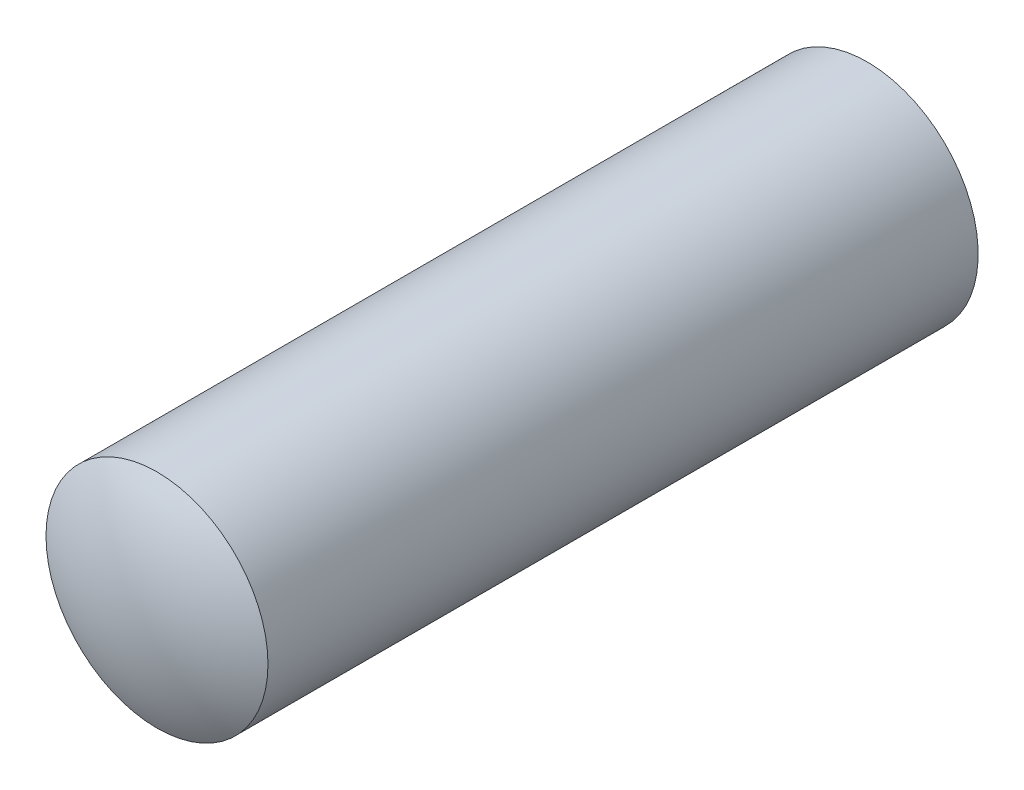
ISO-10303-21;
HEADER;
FILE_DESCRIPTION(('STEP AP214'),'2;1');
FILE_NAME('part.step','',(''),(''),'','','');
FILE_SCHEMA(('AUTOMOTIVE_DESIGN { 1 0 10303 214 1 1 1 1 }'));
ENDSEC;
DATA;
#1=APPLICATION_CONTEXT('core data for automotive mechanical design processes');
#2=APPLICATION_PROTOCOL_DEFINITION('international standard','automotive_design',2000,#1);
#3=PRODUCT_CONTEXT('',#1,'mechanical');
#4=PRODUCT('Part','Part','',(#3));
#5=PRODUCT_RELATED_PRODUCT_CATEGORY('part','',(#4));
#6=PRODUCT_DEFINITION_FORMATION('','',#4);
#7=PRODUCT_DEFINITION_CONTEXT('part definition',#1,'design');
#8=PRODUCT_DEFINITION('design','',#6,#7);
#9=PRODUCT_DEFINITION_SHAPE('','',#8);
#10=(LENGTH_UNIT() NAMED_UNIT(*) SI_UNIT(.MILLI.,.METRE.));
#11=(NAMED_UNIT(*) PLANE_ANGLE_UNIT() SI_UNIT($,.RADIAN.));
#12=(NAMED_UNIT(*) SI_UNIT($,.STERADIAN.) SOLID_ANGLE_UNIT());
#13=UNCERTAINTY_MEASURE_WITH_UNIT(LENGTH_MEASURE(1.E-05),#10,'distance_accuracy_value','');
#14=(GEOMETRIC_REPRESENTATION_CONTEXT(3) GLOBAL_UNCERTAINTY_ASSIGNED_CONTEXT((#13)) GLOBAL_UNIT_ASSIGNED_CONTEXT((#10,
#11,#12)) REPRESENTATION_CONTEXT('',''));
#15=CARTESIAN_POINT('',(0.,0.,0.));
#16=DIRECTION('',(0.,0.,1.));
#17=DIRECTION('',(1.,0.,0.));
#18=AXIS2_PLACEMENT_3D('',#15,#16,#17);
#19=CARTESIAN_POINT('',(0.,0.,14.));
#20=DIRECTION('',(0.,0.,-1.));
#21=DIRECTION('',(1.,0.,0.));
#22=AXIS2_PLACEMENT_3D('',#19,#20,#21);
#23=SPHERICAL_SURFACE('',#22,6.);
#24=CARTESIAN_POINT('',(0.,0.,19.1961524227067));
#25=DIRECTION('',(0.,0.,-1.));
#26=DIRECTION('',(-1.,0.,0.));
#27=AXIS2_PLACEMENT_3D('',#24,#25,#26);
#28=CIRCLE('',#27,3.);
#29=CARTESIAN_POINT('',(-3.,0.,19.1961524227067));
#30=VERTEX_POINT('',#29);
#31=EDGE_CURVE('E9',#30,#30,#28,.T.);
#32=ORIENTED_EDGE('',*,*,#31,.F.);
#33=EDGE_LOOP('',(#32));
#34=FACE_BOUND('',#33,.T.);
#35=ADVANCED_FACE('F14',(#34),#23,.T.);
#36=CARTESIAN_POINT('',(0.,0.,-42.7426335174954));
#37=DIRECTION('',(0.,0.,-1.));
#38=DIRECTION('',(-1.,0.,0.));
#39=AXIS2_PLACEMENT_3D('',#36,#37,#38);
#40=CYLINDRICAL_SURFACE('',#39,3.);
#41=CARTESIAN_POINT('',(0.,0.,0.));
#42=DIRECTION('',(0.,0.,-1.));
#43=DIRECTION('',(-1.,0.,0.));
#44=AXIS2_PLACEMENT_3D('',#41,#42,#43);
#45=CIRCLE('',#44,3.);
#46=CARTESIAN_POINT('',(-3.,0.,0.));
#47=VERTEX_POINT('',#46);
#48=EDGE_CURVE('E21',#47,#47,#45,.T.);
#49=ORIENTED_EDGE('',*,*,#48,.F.);
#50=EDGE_LOOP('',(#49));
#51=FACE_BOUND('',#50,.T.);
#52=ORIENTED_EDGE('',*,*,#31,.T.);
#53=EDGE_LOOP('',(#52));
#54=FACE_BOUND('',#53,.T.);
#55=ADVANCED_FACE('F28',(#51,#54),#40,.T.);
#56=CARTESIAN_POINT('',(2.5,0.,0.));
#57=DIRECTION('',(0.,0.,1.));
#58=DIRECTION('',(1.,0.,0.));
#59=AXIS2_PLACEMENT_3D('',#56,#57,#58);
#60=PLANE('',#59);
#61=ORIENTED_EDGE('',*,*,#48,.T.);
#62=EDGE_LOOP('',(#61));
#63=FACE_BOUND('',#62,.T.);
#64=ADVANCED_FACE('F16',(#63),#60,.F.);
#65=CLOSED_SHELL('',(#35,#55,#64));
#66=MANIFOLD_SOLID_BREP('B1',#65);
#67=ADVANCED_BREP_SHAPE_REPRESENTATION('',(#18,#66),#14);
#68=SHAPE_DEFINITION_REPRESENTATION(#9,#67);
ENDSEC;
END-ISO-10303-21;
